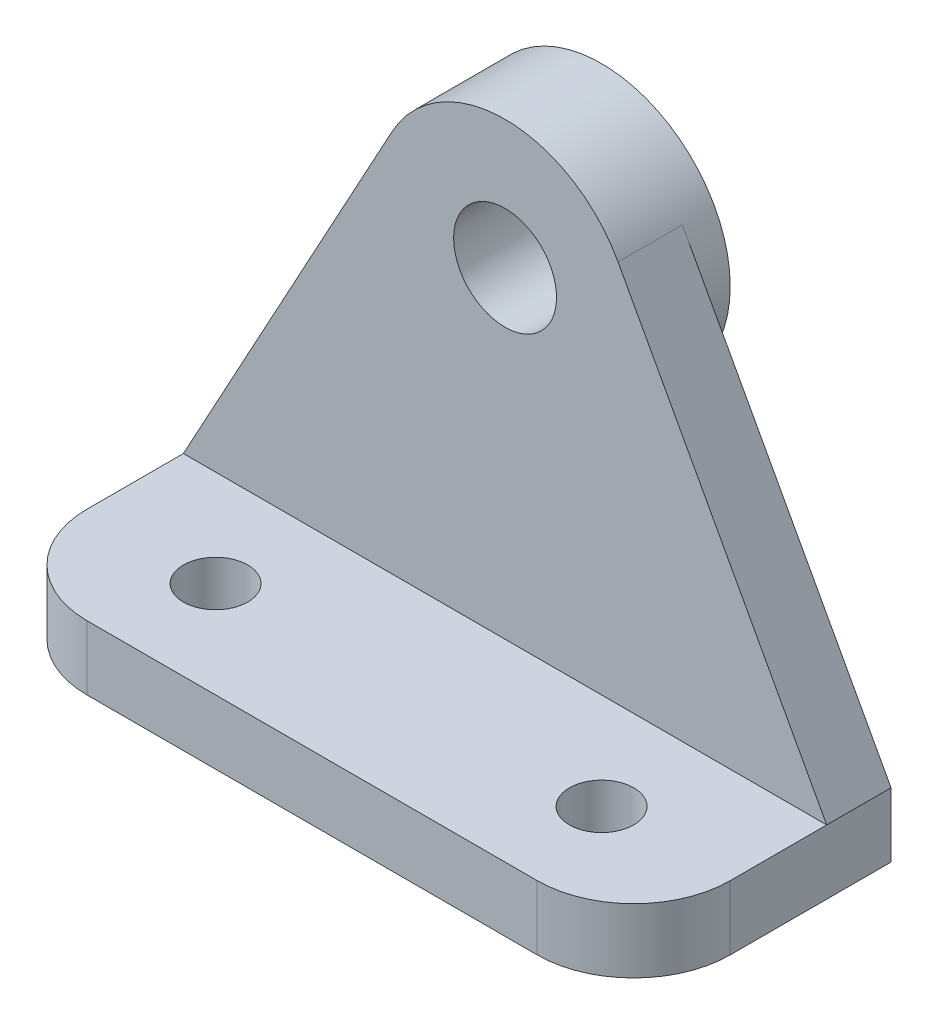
ISO-10303-21;
HEADER;
FILE_DESCRIPTION(('STEP AP214'),'2;1');
FILE_NAME('part.step','',(''),(''),'','','');
FILE_SCHEMA(('AUTOMOTIVE_DESIGN { 1 0 10303 214 1 1 1 1 }'));
ENDSEC;
DATA;
#1=APPLICATION_CONTEXT('core data for automotive mechanical design processes');
#2=APPLICATION_PROTOCOL_DEFINITION('international standard','automotive_design',2000,#1);
#3=PRODUCT_CONTEXT('',#1,'mechanical');
#4=PRODUCT('Part','Part','',(#3));
#5=PRODUCT_RELATED_PRODUCT_CATEGORY('part','',(#4));
#6=PRODUCT_DEFINITION_FORMATION('','',#4);
#7=PRODUCT_DEFINITION_CONTEXT('part definition',#1,'design');
#8=PRODUCT_DEFINITION('design','',#6,#7);
#9=PRODUCT_DEFINITION_SHAPE('','',#8);
#10=(LENGTH_UNIT() NAMED_UNIT(*) SI_UNIT(.MILLI.,.METRE.));
#11=(NAMED_UNIT(*) PLANE_ANGLE_UNIT() SI_UNIT($,.RADIAN.));
#12=(NAMED_UNIT(*) SI_UNIT($,.STERADIAN.) SOLID_ANGLE_UNIT());
#13=UNCERTAINTY_MEASURE_WITH_UNIT(LENGTH_MEASURE(1.E-05),#10,'distance_accuracy_value','');
#14=(GEOMETRIC_REPRESENTATION_CONTEXT(3) GLOBAL_UNCERTAINTY_ASSIGNED_CONTEXT((#13)) GLOBAL_UNIT_ASSIGNED_CONTEXT((#10,
#11,#12)) REPRESENTATION_CONTEXT('',''));
#15=CARTESIAN_POINT('',(0.,0.,0.));
#16=DIRECTION('',(0.,0.,1.));
#17=DIRECTION('',(1.,0.,0.));
#18=AXIS2_PLACEMENT_3D('',#15,#16,#17);
#19=CARTESIAN_POINT('',(0.,10.,0.));
#20=DIRECTION('',(0.,1.,0.));
#21=DIRECTION('',(0.,0.,1.));
#22=AXIS2_PLACEMENT_3D('',#19,#20,#21);
#23=PLANE('',#22);
#24=CARTESIAN_POINT('',(30.,9.99999999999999,-15.));
#25=DIRECTION('',(0.,1.,0.));
#26=DIRECTION('',(0.,0.,1.));
#27=AXIS2_PLACEMENT_3D('',#24,#25,#26);
#28=CIRCLE('',#27,5.);
#29=CARTESIAN_POINT('',(30.,9.99999999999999,-10.));
#30=VERTEX_POINT('',#29);
#31=EDGE_CURVE('E381',#30,#30,#28,.F.);
#32=ORIENTED_EDGE('',*,*,#31,.T.);
#33=EDGE_LOOP('',(#32));
#34=FACE_BOUND('',#33,.T.);
#35=CARTESIAN_POINT('',(-30.,9.99999999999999,-15.));
#36=DIRECTION('',(0.,1.,0.));
#37=DIRECTION('',(0.,0.,1.));
#38=AXIS2_PLACEMENT_3D('',#35,#36,#37);
#39=CIRCLE('',#38,5.);
#40=CARTESIAN_POINT('',(-30.,9.99999999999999,-10.));
#41=VERTEX_POINT('',#40);
#42=EDGE_CURVE('E373',#41,#41,#39,.T.);
#43=ORIENTED_EDGE('',*,*,#42,.F.);
#44=EDGE_LOOP('',(#43));
#45=FACE_BOUND('',#44,.T.);
#46=DIRECTION('',(0.,0.,1.));
#47=VECTOR('',#46,1.);
#48=CARTESIAN_POINT('',(-50.,10.,-40.));
#49=LINE('',#48,#47);
#50=CARTESIAN_POINT('',(-50.,10.,-30.));
#51=VERTEX_POINT('',#50);
#52=CARTESIAN_POINT('',(-50.,10.,-15.));
#53=VERTEX_POINT('',#52);
#54=EDGE_CURVE('E163',#51,#53,#49,.T.);
#55=ORIENTED_EDGE('',*,*,#54,.T.);
#56=CARTESIAN_POINT('',(-35.,10.,-15.));
#57=DIRECTION('',(0.,1.,0.));
#58=DIRECTION('',(0.,0.,1.));
#59=AXIS2_PLACEMENT_3D('',#56,#57,#58);
#60=CIRCLE('',#59,15.);
#61=CARTESIAN_POINT('',(-35.,10.,0.));
#62=VERTEX_POINT('',#61);
#63=EDGE_CURVE('E55',#53,#62,#60,.T.);
#64=ORIENTED_EDGE('',*,*,#63,.T.);
#65=DIRECTION('',(1.,0.,0.));
#66=VECTOR('',#65,1.);
#67=CARTESIAN_POINT('',(-50.,10.,0.));
#68=LINE('',#67,#66);
#69=CARTESIAN_POINT('',(35.,10.,0.));
#70=VERTEX_POINT('',#69);
#71=EDGE_CURVE('E162',#62,#70,#68,.T.);
#72=ORIENTED_EDGE('',*,*,#71,.T.);
#73=CARTESIAN_POINT('',(35.,10.,-15.));
#74=DIRECTION('',(0.,1.,0.));
#75=DIRECTION('',(0.,0.,1.));
#76=AXIS2_PLACEMENT_3D('',#73,#74,#75);
#77=CIRCLE('',#76,15.);
#78=CARTESIAN_POINT('',(50.,10.,-15.));
#79=VERTEX_POINT('',#78);
#80=EDGE_CURVE('E62',#70,#79,#77,.T.);
#81=ORIENTED_EDGE('',*,*,#80,.T.);
#82=DIRECTION('',(0.,0.,-1.));
#83=VECTOR('',#82,1.);
#84=CARTESIAN_POINT('',(50.,10.,0.));
#85=LINE('',#84,#83);
#86=CARTESIAN_POINT('',(50.,10.,-30.));
#87=VERTEX_POINT('',#86);
#88=EDGE_CURVE('E165',#79,#87,#85,.T.);
#89=ORIENTED_EDGE('',*,*,#88,.T.);
#90=DIRECTION('',(-1.,0.,0.));
#91=VECTOR('',#90,1.);
#92=CARTESIAN_POINT('',(50.,10.,-30.));
#93=LINE('',#92,#91);
#94=EDGE_CURVE('E151',#87,#51,#93,.T.);
#95=ORIENTED_EDGE('',*,*,#94,.T.);
#96=EDGE_LOOP('',(#55,#64,#72,#81,#89,#95));
#97=FACE_BOUND('',#96,.T.);
#98=ADVANCED_FACE('F47',(#34,#45,#97),#23,.T.);
#99=CARTESIAN_POINT('',(-50.,10.,-40.));
#100=DIRECTION('',(1.,0.,0.));
#101=DIRECTION('',(0.,0.,-1.));
#102=AXIS2_PLACEMENT_3D('',#99,#100,#101);
#103=PLANE('',#102);
#104=DIRECTION('',(0.,0.,1.));
#105=VECTOR('',#104,1.);
#106=CARTESIAN_POINT('',(-50.,0.,-40.));
#107=LINE('',#106,#105);
#108=CARTESIAN_POINT('',(-50.,0.,-40.));
#109=VERTEX_POINT('',#108);
#110=CARTESIAN_POINT('',(-50.,0.,-15.));
#111=VERTEX_POINT('',#110);
#112=EDGE_CURVE('E156',#109,#111,#107,.T.);
#113=ORIENTED_EDGE('',*,*,#112,.T.);
#114=DIRECTION('',(0.,-1.,0.));
#115=VECTOR('',#114,1.);
#116=CARTESIAN_POINT('',(-50.,10.,-15.));
#117=LINE('',#116,#115);
#118=EDGE_CURVE('E70',#111,#53,#117,.F.);
#119=ORIENTED_EDGE('',*,*,#118,.T.);
#120=ORIENTED_EDGE('',*,*,#54,.F.);
#121=CARTESIAN_POINT('',(-50.,10.,-40.));
#122=VERTEX_POINT('',#121);
#123=EDGE_CURVE('E160',#122,#51,#49,.T.);
#124=ORIENTED_EDGE('',*,*,#123,.F.);
#125=DIRECTION('',(0.,-1.,0.));
#126=VECTOR('',#125,1.);
#127=CARTESIAN_POINT('',(-50.,10.,-40.));
#128=LINE('',#127,#126);
#129=EDGE_CURVE('E146',#122,#109,#128,.T.);
#130=ORIENTED_EDGE('',*,*,#129,.T.);
#131=EDGE_LOOP('',(#113,#119,#120,#124,#130));
#132=FACE_BOUND('',#131,.T.);
#133=ADVANCED_FACE('F203',(#132),#103,.F.);
#134=CARTESIAN_POINT('',(-50.,10.,0.));
#135=DIRECTION('',(0.,0.,-1.));
#136=DIRECTION('',(-1.,0.,0.));
#137=AXIS2_PLACEMENT_3D('',#134,#135,#136);
#138=PLANE('',#137);
#139=ORIENTED_EDGE('',*,*,#71,.F.);
#140=DIRECTION('',(0.,-1.,0.));
#141=VECTOR('',#140,1.);
#142=CARTESIAN_POINT('',(-35.,10.,0.));
#143=LINE('',#142,#141);
#144=CARTESIAN_POINT('',(-35.,0.,0.));
#145=VERTEX_POINT('',#144);
#146=EDGE_CURVE('E181',#62,#145,#143,.T.);
#147=ORIENTED_EDGE('',*,*,#146,.T.);
#148=DIRECTION('',(1.,0.,0.));
#149=VECTOR('',#148,1.);
#150=CARTESIAN_POINT('',(-50.,0.,0.));
#151=LINE('',#150,#149);
#152=CARTESIAN_POINT('',(35.,0.,0.));
#153=VERTEX_POINT('',#152);
#154=EDGE_CURVE('E168',#145,#153,#151,.T.);
#155=ORIENTED_EDGE('',*,*,#154,.T.);
#156=DIRECTION('',(0.,-1.,0.));
#157=VECTOR('',#156,1.);
#158=CARTESIAN_POINT('',(35.,10.,0.));
#159=LINE('',#158,#157);
#160=EDGE_CURVE('E179',#153,#70,#159,.F.);
#161=ORIENTED_EDGE('',*,*,#160,.T.);
#162=EDGE_LOOP('',(#139,#147,#155,#161));
#163=FACE_BOUND('',#162,.T.);
#164=ADVANCED_FACE('F195',(#163),#138,.F.);
#165=CARTESIAN_POINT('',(50.,10.,0.));
#166=DIRECTION('',(-1.,0.,0.));
#167=DIRECTION('',(0.,0.,1.));
#168=AXIS2_PLACEMENT_3D('',#165,#166,#167);
#169=PLANE('',#168);
#170=ORIENTED_EDGE('',*,*,#88,.F.);
#171=DIRECTION('',(0.,-1.,0.));
#172=VECTOR('',#171,1.);
#173=CARTESIAN_POINT('',(50.,10.,-15.));
#174=LINE('',#173,#172);
#175=CARTESIAN_POINT('',(50.,0.,-15.));
#176=VERTEX_POINT('',#175);
#177=EDGE_CURVE('E11',#79,#176,#174,.T.);
#178=ORIENTED_EDGE('',*,*,#177,.T.);
#179=DIRECTION('',(0.,0.,-1.));
#180=VECTOR('',#179,1.);
#181=CARTESIAN_POINT('',(50.,0.,0.));
#182=LINE('',#181,#180);
#183=CARTESIAN_POINT('',(50.,0.,-40.));
#184=VERTEX_POINT('',#183);
#185=EDGE_CURVE('E171',#176,#184,#182,.T.);
#186=ORIENTED_EDGE('',*,*,#185,.T.);
#187=DIRECTION('',(0.,-1.,0.));
#188=VECTOR('',#187,1.);
#189=CARTESIAN_POINT('',(50.,10.,-40.));
#190=LINE('',#189,#188);
#191=CARTESIAN_POINT('',(50.,10.,-40.));
#192=VERTEX_POINT('',#191);
#193=EDGE_CURVE('E176',#192,#184,#190,.T.);
#194=ORIENTED_EDGE('',*,*,#193,.F.);
#195=DIRECTION('',(0.,0.,-1.));
#196=VECTOR('',#195,1.);
#197=CARTESIAN_POINT('',(50.,10.,-30.));
#198=LINE('',#197,#196);
#199=EDGE_CURVE('E142',#87,#192,#198,.T.);
#200=ORIENTED_EDGE('',*,*,#199,.F.);
#201=EDGE_LOOP('',(#170,#178,#186,#194,#200));
#202=FACE_BOUND('',#201,.T.);
#203=ADVANCED_FACE('F215',(#202),#169,.F.);
#204=CARTESIAN_POINT('',(50.,10.,-40.));
#205=DIRECTION('',(0.,0.,1.));
#206=DIRECTION('',(1.,0.,0.));
#207=AXIS2_PLACEMENT_3D('',#204,#205,#206);
#208=PLANE('',#207);
#209=DIRECTION('',(0.478232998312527,0.878232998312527,0.));
#210=VECTOR('',#209,1.);
#211=CARTESIAN_POINT('',(-50.,10.,-40.));
#212=LINE('',#211,#210);
#213=CARTESIAN_POINT('',(-17.5646599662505,69.5646599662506,-40.));
#214=VERTEX_POINT('',#213);
#215=EDGE_CURVE('E138',#122,#214,#212,.T.);
#216=ORIENTED_EDGE('',*,*,#215,.T.);
#217=CARTESIAN_POINT('',(0.,60.,-40.));
#218=DIRECTION('',(0.,0.,1.));
#219=DIRECTION('',(1.,0.,0.));
#220=AXIS2_PLACEMENT_3D('',#217,#218,#219);
#221=CIRCLE('',#220,20.);
#222=CARTESIAN_POINT('',(17.5646599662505,69.5646599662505,-40.));
#223=VERTEX_POINT('',#222);
#224=EDGE_CURVE('E120',#214,#223,#221,.T.);
#225=ORIENTED_EDGE('',*,*,#224,.T.);
#226=DIRECTION('',(0.478232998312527,-0.878232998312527,0.));
#227=VECTOR('',#226,1.);
#228=CARTESIAN_POINT('',(17.5646599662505,69.5646599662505,-40.));
#229=LINE('',#228,#227);
#230=EDGE_CURVE('E132',#223,#192,#229,.T.);
#231=ORIENTED_EDGE('',*,*,#230,.T.);
#232=ORIENTED_EDGE('',*,*,#193,.T.);
#233=DIRECTION('',(-1.,0.,0.));
#234=VECTOR('',#233,1.);
#235=CARTESIAN_POINT('',(50.,0.,-40.));
#236=LINE('',#235,#234);
#237=EDGE_CURVE('E173',#184,#109,#236,.T.);
#238=ORIENTED_EDGE('',*,*,#237,.T.);
#239=ORIENTED_EDGE('',*,*,#129,.F.);
#240=EDGE_LOOP('',(#216,#225,#231,#232,#238,#239));
#241=FACE_BOUND('',#240,.T.);
#242=ADVANCED_FACE('F144',(#241),#208,.F.);
#243=CARTESIAN_POINT('',(0.,0.,0.));
#244=DIRECTION('',(0.,1.,0.));
#245=DIRECTION('',(0.,0.,1.));
#246=AXIS2_PLACEMENT_3D('',#243,#244,#245);
#247=PLANE('',#246);
#248=CARTESIAN_POINT('',(30.,0.,-15.));
#249=DIRECTION('',(0.,1.,0.));
#250=DIRECTION('',(0.,0.,-1.));
#251=AXIS2_PLACEMENT_3D('',#248,#249,#250);
#252=CIRCLE('',#251,5.);
#253=CARTESIAN_POINT('',(30.,0.,-20.));
#254=VERTEX_POINT('',#253);
#255=EDGE_CURVE('E383',#254,#254,#252,.T.);
#256=ORIENTED_EDGE('',*,*,#255,.T.);
#257=EDGE_LOOP('',(#256));
#258=FACE_BOUND('',#257,.T.);
#259=CARTESIAN_POINT('',(-30.,0.,-15.));
#260=DIRECTION('',(0.,-1.,0.));
#261=DIRECTION('',(0.,0.,-1.));
#262=AXIS2_PLACEMENT_3D('',#259,#260,#261);
#263=CIRCLE('',#262,5.);
#264=CARTESIAN_POINT('',(-30.,0.,-20.));
#265=VERTEX_POINT('',#264);
#266=EDGE_CURVE('E378',#265,#265,#263,.T.);
#267=ORIENTED_EDGE('',*,*,#266,.F.);
#268=EDGE_LOOP('',(#267));
#269=FACE_BOUND('',#268,.T.);
#270=ORIENTED_EDGE('',*,*,#154,.F.);
#271=CARTESIAN_POINT('',(-35.,0.,-15.));
#272=DIRECTION('',(0.,1.,0.));
#273=DIRECTION('',(0.,0.,1.));
#274=AXIS2_PLACEMENT_3D('',#271,#272,#273);
#275=CIRCLE('',#274,15.);
#276=EDGE_CURVE('E186',#145,#111,#275,.F.);
#277=ORIENTED_EDGE('',*,*,#276,.T.);
#278=ORIENTED_EDGE('',*,*,#112,.F.);
#279=ORIENTED_EDGE('',*,*,#237,.F.);
#280=ORIENTED_EDGE('',*,*,#185,.F.);
#281=CARTESIAN_POINT('',(35.,0.,-15.));
#282=DIRECTION('',(0.,1.,0.));
#283=DIRECTION('',(0.,0.,1.));
#284=AXIS2_PLACEMENT_3D('',#281,#282,#283);
#285=CIRCLE('',#284,15.);
#286=EDGE_CURVE('E184',#176,#153,#285,.F.);
#287=ORIENTED_EDGE('',*,*,#286,.T.);
#288=EDGE_LOOP('',(#270,#277,#278,#279,#280,#287));
#289=FACE_BOUND('',#288,.T.);
#290=ADVANCED_FACE('F201',(#258,#269,#289),#247,.F.);
#291=CARTESIAN_POINT('',(17.5646599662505,69.5646599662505,-30.));
#292=DIRECTION('',(0.878232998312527,0.478232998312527,0.));
#293=DIRECTION('',(-0.478232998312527,0.878232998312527,0.));
#294=AXIS2_PLACEMENT_3D('',#291,#292,#293);
#295=PLANE('',#294);
#296=ORIENTED_EDGE('',*,*,#230,.F.);
#297=DIRECTION('',(0.,0.,-1.));
#298=VECTOR('',#297,1.);
#299=CARTESIAN_POINT('',(17.5646599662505,69.5646599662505,-30.));
#300=LINE('',#299,#298);
#301=CARTESIAN_POINT('',(17.5646599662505,69.5646599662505,-30.));
#302=VERTEX_POINT('',#301);
#303=EDGE_CURVE('E127',#302,#223,#300,.T.);
#304=ORIENTED_EDGE('',*,*,#303,.F.);
#305=DIRECTION('',(0.478232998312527,-0.878232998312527,0.));
#306=VECTOR('',#305,1.);
#307=CARTESIAN_POINT('',(17.5646599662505,69.5646599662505,-30.));
#308=LINE('',#307,#306);
#309=EDGE_CURVE('E148',#302,#87,#308,.T.);
#310=ORIENTED_EDGE('',*,*,#309,.T.);
#311=ORIENTED_EDGE('',*,*,#199,.T.);
#312=EDGE_LOOP('',(#296,#304,#310,#311));
#313=FACE_BOUND('',#312,.T.);
#314=ADVANCED_FACE('F212',(#313),#295,.T.);
#315=CARTESIAN_POINT('',(0.,60.,-30.));
#316=DIRECTION('',(0.,0.,-1.));
#317=DIRECTION('',(-1.,0.,0.));
#318=AXIS2_PLACEMENT_3D('',#315,#316,#317);
#319=CYLINDRICAL_SURFACE('',#318,20.);
#320=ORIENTED_EDGE('',*,*,#303,.T.);
#321=ORIENTED_EDGE('',*,*,#224,.F.);
#322=DIRECTION('',(0.,0.,-1.));
#323=VECTOR('',#322,1.);
#324=CARTESIAN_POINT('',(-17.5646599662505,69.5646599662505,-30.));
#325=LINE('',#324,#323);
#326=CARTESIAN_POINT('',(-17.5646599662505,69.5646599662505,-30.));
#327=VERTEX_POINT('',#326);
#328=EDGE_CURVE('E125',#327,#214,#325,.T.);
#329=ORIENTED_EDGE('',*,*,#328,.F.);
#330=CARTESIAN_POINT('',(0.,60.,-30.));
#331=DIRECTION('',(0.,0.,-1.));
#332=DIRECTION('',(-1.,0.,0.));
#333=AXIS2_PLACEMENT_3D('',#330,#331,#332);
#334=CIRCLE('',#333,20.);
#335=EDGE_CURVE('E159',#327,#302,#334,.T.);
#336=ORIENTED_EDGE('',*,*,#335,.T.);
#337=EDGE_LOOP('',(#320,#321,#329,#336));
#338=FACE_BOUND('',#337,.T.);
#339=CARTESIAN_POINT('',(0.,60.,-45.));
#340=DIRECTION('',(0.,0.,1.));
#341=DIRECTION('',(1.,0.,0.));
#342=AXIS2_PLACEMENT_3D('',#339,#340,#341);
#343=CIRCLE('',#342,20.);
#344=CARTESIAN_POINT('',(20.,60.,-45.));
#345=VERTEX_POINT('',#344);
#346=EDGE_CURVE('E133',#345,#345,#343,.T.);
#347=ORIENTED_EDGE('',*,*,#346,.T.);
#348=EDGE_LOOP('',(#347));
#349=FACE_BOUND('',#348,.T.);
#350=ADVANCED_FACE('F122',(#338,#349),#319,.T.);
#351=CARTESIAN_POINT('',(-50.,10.,-30.));
#352=DIRECTION('',(-0.878232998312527,0.478232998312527,0.));
#353=DIRECTION('',(-0.478232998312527,-0.878232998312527,0.));
#354=AXIS2_PLACEMENT_3D('',#351,#352,#353);
#355=PLANE('',#354);
#356=ORIENTED_EDGE('',*,*,#215,.F.);
#357=ORIENTED_EDGE('',*,*,#123,.T.);
#358=DIRECTION('',(0.478232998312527,0.878232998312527,0.));
#359=VECTOR('',#358,1.);
#360=CARTESIAN_POINT('',(-50.,10.,-30.));
#361=LINE('',#360,#359);
#362=EDGE_CURVE('E140',#51,#327,#361,.T.);
#363=ORIENTED_EDGE('',*,*,#362,.T.);
#364=ORIENTED_EDGE('',*,*,#328,.T.);
#365=EDGE_LOOP('',(#356,#357,#363,#364));
#366=FACE_BOUND('',#365,.T.);
#367=ADVANCED_FACE('F136',(#366),#355,.T.);
#368=CARTESIAN_POINT('',(0.,60.,-30.));
#369=DIRECTION('',(0.,0.,-1.));
#370=DIRECTION('',(-1.,0.,0.));
#371=AXIS2_PLACEMENT_3D('',#368,#369,#370);
#372=PLANE('',#371);
#373=CARTESIAN_POINT('',(0.,60.,-30.));
#374=DIRECTION('',(0.,0.,-1.));
#375=DIRECTION('',(-1.,0.,0.));
#376=AXIS2_PLACEMENT_3D('',#373,#374,#375);
#377=CIRCLE('',#376,8.);
#378=CARTESIAN_POINT('',(-8.,60.,-30.));
#379=VERTEX_POINT('',#378);
#380=EDGE_CURVE('E366',#379,#379,#377,.T.);
#381=ORIENTED_EDGE('',*,*,#380,.T.);
#382=EDGE_LOOP('',(#381));
#383=FACE_BOUND('',#382,.T.);
#384=ORIENTED_EDGE('',*,*,#309,.F.);
#385=ORIENTED_EDGE('',*,*,#335,.F.);
#386=ORIENTED_EDGE('',*,*,#362,.F.);
#387=ORIENTED_EDGE('',*,*,#94,.F.);
#388=EDGE_LOOP('',(#384,#385,#386,#387));
#389=FACE_BOUND('',#388,.T.);
#390=ADVANCED_FACE('F209',(#383,#389),#372,.F.);
#391=CARTESIAN_POINT('',(0.,60.,-45.));
#392=DIRECTION('',(0.,0.,1.));
#393=DIRECTION('',(1.,0.,0.));
#394=AXIS2_PLACEMENT_3D('',#391,#392,#393);
#395=PLANE('',#394);
#396=CARTESIAN_POINT('',(0.,60.,-45.));
#397=DIRECTION('',(0.,0.,-1.));
#398=DIRECTION('',(-1.,0.,0.));
#399=AXIS2_PLACEMENT_3D('',#396,#397,#398);
#400=CIRCLE('',#399,8.);
#401=CARTESIAN_POINT('',(-8.,60.,-45.));
#402=VERTEX_POINT('',#401);
#403=EDGE_CURVE('E368',#402,#402,#400,.T.);
#404=ORIENTED_EDGE('',*,*,#403,.F.);
#405=EDGE_LOOP('',(#404));
#406=FACE_BOUND('',#405,.T.);
#407=ORIENTED_EDGE('',*,*,#346,.F.);
#408=EDGE_LOOP('',(#407));
#409=FACE_BOUND('',#408,.T.);
#410=ADVANCED_FACE('F299',(#406,#409),#395,.F.);
#411=CARTESIAN_POINT('',(0.,60.,0.));
#412=DIRECTION('',(0.,0.,-1.));
#413=DIRECTION('',(-1.,0.,0.));
#414=AXIS2_PLACEMENT_3D('',#411,#412,#413);
#415=CYLINDRICAL_SURFACE('',#414,8.);
#416=CARTESIAN_POINT('',(-8.,60.,-45.));
#417=CARTESIAN_POINT('',(-8.,60.,-44.84375));
#418=CARTESIAN_POINT('',(-8.,60.,-44.6875));
#419=CARTESIAN_POINT('',(-8.,60.,-44.375));
#420=CARTESIAN_POINT('',(-8.,60.,-44.21875));
#421=CARTESIAN_POINT('',(-8.,60.,-43.90625));
#422=CARTESIAN_POINT('',(-8.,60.,-43.75));
#423=CARTESIAN_POINT('',(-8.,60.,-43.4375));
#424=CARTESIAN_POINT('',(-8.,60.,-43.28125));
#425=CARTESIAN_POINT('',(-8.,60.,-42.96875));
#426=CARTESIAN_POINT('',(-8.,60.,-42.8125));
#427=CARTESIAN_POINT('',(-8.,60.,-42.5));
#428=CARTESIAN_POINT('',(-8.,60.,-42.34375));
#429=CARTESIAN_POINT('',(-8.,60.,-42.03125));
#430=CARTESIAN_POINT('',(-8.,60.,-41.875));
#431=CARTESIAN_POINT('',(-8.,60.,-41.5625));
#432=CARTESIAN_POINT('',(-8.,60.,-41.40625));
#433=CARTESIAN_POINT('',(-8.,60.,-41.09375));
#434=CARTESIAN_POINT('',(-8.,60.,-40.9375));
#435=CARTESIAN_POINT('',(-8.,60.,-40.625));
#436=CARTESIAN_POINT('',(-8.,60.,-40.46875));
#437=CARTESIAN_POINT('',(-8.,60.,-40.15625));
#438=CARTESIAN_POINT('',(-8.,60.,-40.));
#439=CARTESIAN_POINT('',(-8.,60.,-39.6875));
#440=CARTESIAN_POINT('',(-8.,60.,-39.53125));
#441=CARTESIAN_POINT('',(-8.,60.,-39.21875));
#442=CARTESIAN_POINT('',(-8.,60.,-39.0625));
#443=CARTESIAN_POINT('',(-8.,60.,-38.75));
#444=CARTESIAN_POINT('',(-8.,60.,-38.59375));
#445=CARTESIAN_POINT('',(-8.,60.,-38.28125));
#446=CARTESIAN_POINT('',(-8.,60.,-38.125));
#447=CARTESIAN_POINT('',(-8.,60.,-37.8125));
#448=CARTESIAN_POINT('',(-8.,60.,-37.65625));
#449=CARTESIAN_POINT('',(-8.,60.,-37.34375));
#450=CARTESIAN_POINT('',(-8.,60.,-37.1875));
#451=CARTESIAN_POINT('',(-8.,60.,-36.875));
#452=CARTESIAN_POINT('',(-8.,60.,-36.71875));
#453=CARTESIAN_POINT('',(-8.,60.,-36.40625));
#454=CARTESIAN_POINT('',(-8.,60.,-36.25));
#455=CARTESIAN_POINT('',(-8.,60.,-35.9375));
#456=CARTESIAN_POINT('',(-8.,60.,-35.78125));
#457=CARTESIAN_POINT('',(-8.,60.,-35.46875));
#458=CARTESIAN_POINT('',(-8.,60.,-35.3125));
#459=CARTESIAN_POINT('',(-8.,60.,-35.));
#460=CARTESIAN_POINT('',(-8.,60.,-34.84375));
#461=CARTESIAN_POINT('',(-8.,60.,-34.53125));
#462=CARTESIAN_POINT('',(-8.,60.,-34.375));
#463=CARTESIAN_POINT('',(-8.,60.,-34.0625));
#464=CARTESIAN_POINT('',(-8.,60.,-33.90625));
#465=CARTESIAN_POINT('',(-8.,60.,-33.59375));
#466=CARTESIAN_POINT('',(-8.,60.,-33.4375));
#467=CARTESIAN_POINT('',(-8.,60.,-33.125));
#468=CARTESIAN_POINT('',(-8.,60.,-32.96875));
#469=CARTESIAN_POINT('',(-8.,60.,-32.65625));
#470=CARTESIAN_POINT('',(-8.,60.,-32.5));
#471=CARTESIAN_POINT('',(-8.,60.,-32.1875));
#472=CARTESIAN_POINT('',(-8.,60.,-32.03125));
#473=CARTESIAN_POINT('',(-8.,60.,-31.71875));
#474=CARTESIAN_POINT('',(-8.,60.,-31.5625));
#475=CARTESIAN_POINT('',(-8.,60.,-31.25));
#476=CARTESIAN_POINT('',(-8.,60.,-31.09375));
#477=CARTESIAN_POINT('',(-8.,60.,-30.78125));
#478=CARTESIAN_POINT('',(-8.,60.,-30.625));
#479=CARTESIAN_POINT('',(-8.,60.,-30.3125));
#480=CARTESIAN_POINT('',(-8.,60.,-30.15625));
#481=CARTESIAN_POINT('',(-8.,60.,-30.));
#482=B_SPLINE_CURVE_WITH_KNOTS('',3,(#416,#417,#418,#419,#420,#421,#422,#423,#424,#425,#426,
#427,#428,#429,#430,#431,#432,#433,#434,#435,#436,#437,#438,#439,#440,#441,#442,#443,#444,#445,
#446,#447,#448,#449,#450,#451,#452,#453,#454,#455,#456,#457,#458,#459,#460,#461,#462,#463,#464,
#465,#466,#467,#468,#469,#470,#471,#472,#473,#474,#475,#476,#477,#478,#479,#480,#481),
.UNSPECIFIED.,.F.,.F.,(4,2,2,2,2,2,2,2,2,2,2,2,2,2,2,2,2,2,2,2,2,2,2,2,2,2,2,2,2,2,2,2,4),(0.,
0.468749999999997,0.937500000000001,1.40625,1.875,2.34375,2.8125,3.28125,3.75,4.21875,4.6875,
5.15625,5.625,6.09375,6.5625,7.03125,7.5,7.96875,8.4375,8.90625,9.375,9.84375,10.3125,10.78125,
11.25,11.71875,12.1875,12.65625,13.125,13.59375,14.0625,14.53125,15.),.UNSPECIFIED.);
#483=EDGE_CURVE('BSEAM289',#402,#379,#482,.T.);
#484=ORIENTED_EDGE('',*,*,#403,.T.);
#485=ORIENTED_EDGE('',*,*,#380,.F.);
#486=ORIENTED_EDGE('',*,*,#483,.T.);
#487=ORIENTED_EDGE('',*,*,#483,.F.);
#488=EDGE_LOOP('',(#484,#486,#485,#487));
#489=FACE_BOUND('',#488,.T.);
#490=ADVANCED_FACE('F289',(#489),#415,.F.);
#491=CARTESIAN_POINT('',(-30.,80.,-15.));
#492=DIRECTION('',(0.,-1.,0.));
#493=DIRECTION('',(0.,0.,-1.));
#494=AXIS2_PLACEMENT_3D('',#491,#492,#493);
#495=CYLINDRICAL_SURFACE('',#494,5.);
#496=ORIENTED_EDGE('',*,*,#42,.T.);
#497=EDGE_LOOP('',(#496));
#498=FACE_BOUND('',#497,.T.);
#499=ORIENTED_EDGE('',*,*,#266,.T.);
#500=EDGE_LOOP('',(#499));
#501=FACE_BOUND('',#500,.T.);
#502=ADVANCED_FACE('F279',(#498,#501),#495,.F.);
#503=CARTESIAN_POINT('',(30.,80.,-15.));
#504=DIRECTION('',(0.,-1.,0.));
#505=DIRECTION('',(0.,0.,-1.));
#506=AXIS2_PLACEMENT_3D('',#503,#504,#505);
#507=CYLINDRICAL_SURFACE('',#506,5.);
#508=ORIENTED_EDGE('',*,*,#31,.F.);
#509=EDGE_LOOP('',(#508));
#510=FACE_BOUND('',#509,.T.);
#511=ORIENTED_EDGE('',*,*,#255,.F.);
#512=EDGE_LOOP('',(#511));
#513=FACE_BOUND('',#512,.T.);
#514=ADVANCED_FACE('F223',(#510,#513),#507,.F.);
#515=CARTESIAN_POINT('',(-35.,10.,-15.));
#516=DIRECTION('',(0.,-1.,0.));
#517=DIRECTION('',(0.,0.,-1.));
#518=AXIS2_PLACEMENT_3D('',#515,#516,#517);
#519=CYLINDRICAL_SURFACE('',#518,15.);
#520=ORIENTED_EDGE('',*,*,#63,.F.);
#521=ORIENTED_EDGE('',*,*,#118,.F.);
#522=ORIENTED_EDGE('',*,*,#276,.F.);
#523=ORIENTED_EDGE('',*,*,#146,.F.);
#524=EDGE_LOOP('',(#520,#521,#522,#523));
#525=FACE_BOUND('',#524,.T.);
#526=ADVANCED_FACE('F198',(#525),#519,.T.);
#527=CARTESIAN_POINT('',(35.,10.,-15.));
#528=DIRECTION('',(0.,-1.,0.));
#529=DIRECTION('',(0.,0.,-1.));
#530=AXIS2_PLACEMENT_3D('',#527,#528,#529);
#531=CYLINDRICAL_SURFACE('',#530,15.);
#532=ORIENTED_EDGE('',*,*,#80,.F.);
#533=ORIENTED_EDGE('',*,*,#160,.F.);
#534=ORIENTED_EDGE('',*,*,#286,.F.);
#535=ORIENTED_EDGE('',*,*,#177,.F.);
#536=EDGE_LOOP('',(#532,#533,#534,#535));
#537=FACE_BOUND('',#536,.T.);
#538=ADVANCED_FACE('F49',(#537),#531,.T.);
#539=CLOSED_SHELL('',(#98,#133,#164,#203,#242,#290,#314,#350,#367,#390,#410,#490,#502,#514,#526,#538));
#540=MANIFOLD_SOLID_BREP('B2',#539);
#541=ADVANCED_BREP_SHAPE_REPRESENTATION('',(#18,#540),#14);
#542=SHAPE_DEFINITION_REPRESENTATION(#9,#541);
ENDSEC;
END-ISO-10303-21;
